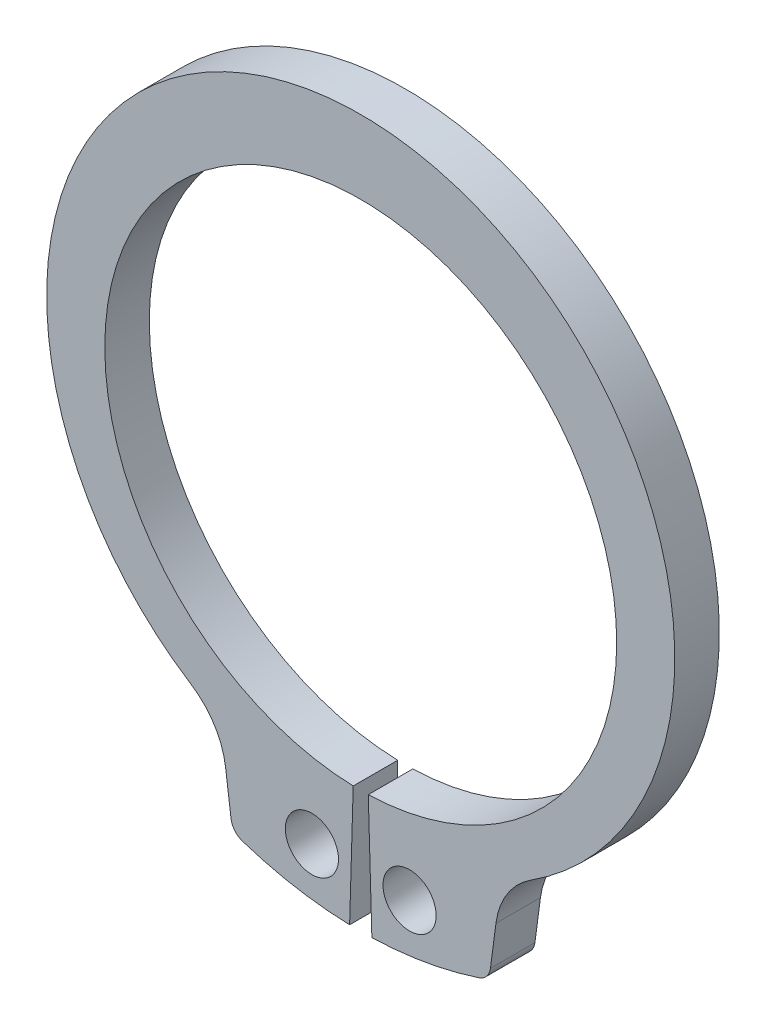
from build123d import *

# Parameters (mm, degrees)
BODYSKE_R  = 0.5969
BODY_DEPTH = 1


with BuildPart() as part:
    # BodySke → Body (new body)
    with BuildSketch(Plane.XY):
        with BuildLine():
            Line((0.169253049, -5.747508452), (0.25, -8.489519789))
            ThreePointArc((0.25, -8.489519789), (1.46763309, -8.365434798), (2.654787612, -8.067623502))
            ThreePointArc((2.654787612, -8.067623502), (2.829079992, -7.94879171), (2.913435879, -7.755445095))
            Line((2.913435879, -7.755445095), (3.037113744, -6.816018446))
            ThreePointArc((3.037113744, -6.816018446), (3.290846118, -6.116653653), (3.815283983, -5.588964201))
            ThreePointArc((3.815283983, -5.588964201), (0, 7.401), (-3.815283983, -5.588964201))
            ThreePointArc((-3.815283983, -5.588964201), (-3.290846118, -6.116653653), (-3.037113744, -6.816018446))
            Line((-3.037113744, -6.816018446), (-2.913435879, -7.755445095))
            ThreePointArc((-2.913435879, -7.755445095), (-2.829079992, -7.94879171), (-2.654787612, -8.067623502))
            ThreePointArc((-2.654787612, -8.067623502), (-1.46763309, -8.365434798), (-0.25, -8.489519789))
            Line((-0.25, -8.489519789), (-0.169253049, -5.747508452))
            ThreePointArc((-0.169253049, -5.747508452), (0, 5.75), (0.169253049, -5.747508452))
        make_face()
        with Locations((1.0969, -7.340092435)):
            Circle(BODYSKE_R, mode=Mode.SUBTRACT)
        with Locations((-1.0969, -7.340092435)):
            Circle(BODYSKE_R, mode=Mode.SUBTRACT)
    extrude(amount=-BODY_DEPTH)


solid = part.part
